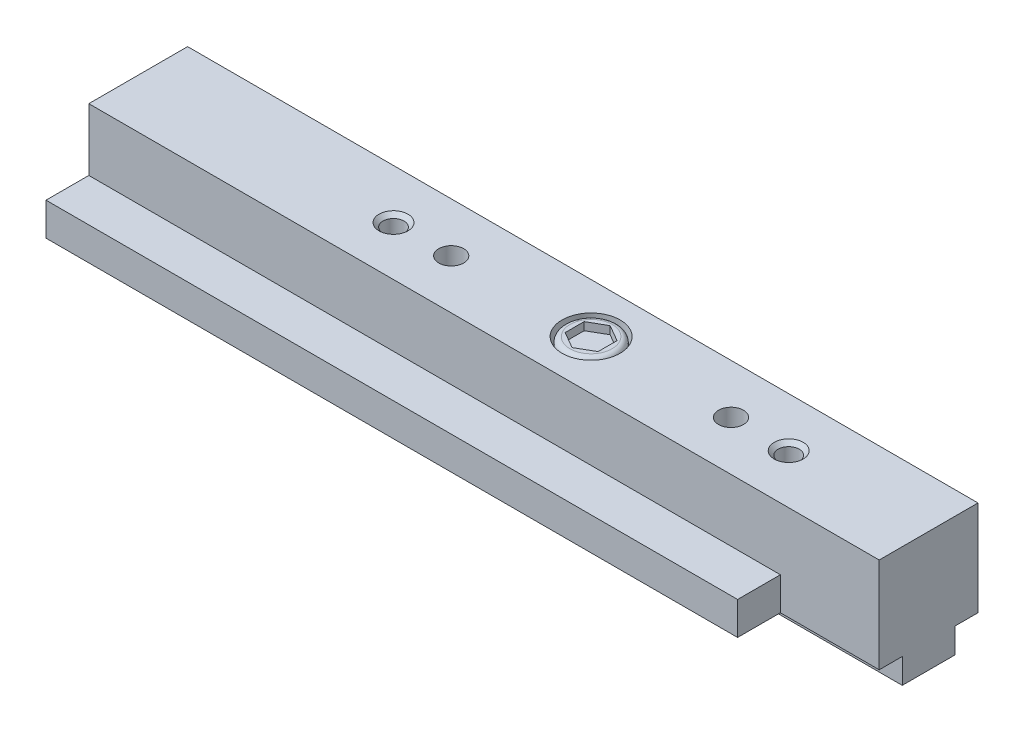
ISO-10303-21;
HEADER;
FILE_DESCRIPTION(('STEP AP214'),'2;1');
FILE_NAME('part.step','',(''),(''),'','','');
FILE_SCHEMA(('AUTOMOTIVE_DESIGN { 1 0 10303 214 1 1 1 1 }'));
ENDSEC;
DATA;
#1=APPLICATION_CONTEXT('core data for automotive mechanical design processes');
#2=APPLICATION_PROTOCOL_DEFINITION('international standard','automotive_design',2000,#1);
#3=PRODUCT_CONTEXT('',#1,'mechanical');
#4=PRODUCT('Part','Part','',(#3));
#5=PRODUCT_RELATED_PRODUCT_CATEGORY('part','',(#4));
#6=PRODUCT_DEFINITION_FORMATION('','',#4);
#7=PRODUCT_DEFINITION_CONTEXT('part definition',#1,'design');
#8=PRODUCT_DEFINITION('design','',#6,#7);
#9=PRODUCT_DEFINITION_SHAPE('','',#8);
#10=(LENGTH_UNIT() NAMED_UNIT(*) SI_UNIT(.MILLI.,.METRE.));
#11=(NAMED_UNIT(*) PLANE_ANGLE_UNIT() SI_UNIT($,.RADIAN.));
#12=(NAMED_UNIT(*) SI_UNIT($,.STERADIAN.) SOLID_ANGLE_UNIT());
#13=UNCERTAINTY_MEASURE_WITH_UNIT(LENGTH_MEASURE(1.E-05),#10,'distance_accuracy_value','');
#14=(GEOMETRIC_REPRESENTATION_CONTEXT(3) GLOBAL_UNCERTAINTY_ASSIGNED_CONTEXT((#13)) GLOBAL_UNIT_ASSIGNED_CONTEXT((#10,
#11,#12)) REPRESENTATION_CONTEXT('',''));
#15=CARTESIAN_POINT('',(0.,0.,0.));
#16=DIRECTION('',(0.,0.,1.));
#17=DIRECTION('',(1.,0.,0.));
#18=AXIS2_PLACEMENT_3D('',#15,#16,#17);
#19=CARTESIAN_POINT('',(43.6626,10.0584,0.));
#20=DIRECTION('',(0.,1.,0.));
#21=DIRECTION('',(0.,0.,1.));
#22=AXIS2_PLACEMENT_3D('',#19,#20,#21);
#23=PLANE('',#22);
#24=CARTESIAN_POINT('',(43.6626,10.0584,0.));
#25=DIRECTION('',(0.,1.,0.));
#26=DIRECTION('',(0.,0.,1.));
#27=AXIS2_PLACEMENT_3D('',#24,#25,#26);
#28=CIRCLE('',#27,2.794);
#29=CARTESIAN_POINT('',(43.6626,10.0584,2.794));
#30=VERTEX_POINT('',#29);
#31=EDGE_CURVE('E242',#30,#30,#28,.T.);
#32=ORIENTED_EDGE('',*,*,#31,.T.);
#33=EDGE_LOOP('',(#32));
#34=FACE_BOUND('',#33,.T.);
#35=CARTESIAN_POINT('',(43.6626,10.0584,0.));
#36=DIRECTION('',(0.,1.,0.));
#37=DIRECTION('',(0.,0.,1.));
#38=AXIS2_PLACEMENT_3D('',#35,#36,#37);
#39=CIRCLE('',#38,2.54);
#40=CARTESIAN_POINT('',(43.6626,10.0584,2.54));
#41=VERTEX_POINT('',#40);
#42=EDGE_CURVE('E225',#41,#41,#39,.T.);
#43=ORIENTED_EDGE('',*,*,#42,.F.);
#44=EDGE_LOOP('',(#43));
#45=FACE_BOUND('',#44,.T.);
#46=ADVANCED_FACE('F33',(#34,#45),#23,.T.);
#47=CARTESIAN_POINT('',(66.675,11.5824,-4.7625));
#48=DIRECTION('',(0.,-1.,0.));
#49=DIRECTION('',(0.,0.,-1.));
#50=AXIS2_PLACEMENT_3D('',#47,#48,#49);
#51=PLANE('',#50);
#52=CARTESIAN_POINT('',(43.6626,11.5824,0.));
#53=DIRECTION('',(0.,1.,0.));
#54=DIRECTION('',(0.,0.,1.));
#55=AXIS2_PLACEMENT_3D('',#52,#53,#54);
#56=CIRCLE('',#55,2.794);
#57=CARTESIAN_POINT('',(43.6626,11.5824,2.794));
#58=VERTEX_POINT('',#57);
#59=EDGE_CURVE('E241',#58,#58,#56,.T.);
#60=ORIENTED_EDGE('',*,*,#59,.F.);
#61=EDGE_LOOP('',(#60));
#62=FACE_BOUND('',#61,.T.);
#63=CARTESIAN_POINT('',(30.1752,11.5824,0.));
#64=DIRECTION('',(0.,1.,0.));
#65=DIRECTION('',(0.,0.,1.));
#66=AXIS2_PLACEMENT_3D('',#63,#64,#65);
#67=CIRCLE('',#66,1.20269);
#68=CARTESIAN_POINT('',(30.1752,11.5824,1.20269));
#69=VERTEX_POINT('',#68);
#70=EDGE_CURVE('E245',#69,#69,#67,.T.);
#71=ORIENTED_EDGE('',*,*,#70,.F.);
#72=EDGE_LOOP('',(#71));
#73=FACE_BOUND('',#72,.T.);
#74=CARTESIAN_POINT('',(57.15,11.5824,0.));
#75=DIRECTION('',(0.,1.,0.));
#76=DIRECTION('',(0.,0.,1.));
#77=AXIS2_PLACEMENT_3D('',#74,#75,#76);
#78=CIRCLE('',#77,1.20269);
#79=CARTESIAN_POINT('',(57.15,11.5824,1.20269));
#80=VERTEX_POINT('',#79);
#81=EDGE_CURVE('E251',#80,#80,#78,.T.);
#82=ORIENTED_EDGE('',*,*,#81,.F.);
#83=EDGE_LOOP('',(#82));
#84=FACE_BOUND('',#83,.T.);
#85=CARTESIAN_POINT('',(62.7126,11.5824,0.));
#86=DIRECTION('',(0.,1.,0.));
#87=DIRECTION('',(0.,0.,1.));
#88=AXIS2_PLACEMENT_3D('',#85,#86,#87);
#89=CIRCLE('',#88,1.397);
#90=CARTESIAN_POINT('',(62.7126,11.5824,1.397));
#91=VERTEX_POINT('',#90);
#92=EDGE_CURVE('E274',#91,#91,#89,.T.);
#93=ORIENTED_EDGE('',*,*,#92,.F.);
#94=EDGE_LOOP('',(#93));
#95=FACE_BOUND('',#94,.T.);
#96=DIRECTION('',(0.,0.,1.));
#97=VECTOR('',#96,1.);
#98=CARTESIAN_POINT('',(0.,11.5824,-4.7625));
#99=LINE('',#98,#97);
#100=CARTESIAN_POINT('',(0.,11.5824,-4.7625));
#101=VERTEX_POINT('',#100);
#102=CARTESIAN_POINT('',(0.,11.5824,4.7625));
#103=VERTEX_POINT('',#102);
#104=EDGE_CURVE('E400',#101,#103,#99,.T.);
#105=ORIENTED_EDGE('',*,*,#104,.T.);
#106=DIRECTION('',(-1.,0.,0.));
#107=VECTOR('',#106,1.);
#108=CARTESIAN_POINT('',(66.675,11.5824,4.7625));
#109=LINE('',#108,#107);
#110=CARTESIAN_POINT('',(76.2,11.5824,4.7625));
#111=VERTEX_POINT('',#110);
#112=EDGE_CURVE('E336',#111,#103,#109,.T.);
#113=ORIENTED_EDGE('',*,*,#112,.F.);
#114=DIRECTION('',(0.,0.,1.));
#115=VECTOR('',#114,1.);
#116=CARTESIAN_POINT('',(76.2,11.5824,-4.7625));
#117=LINE('',#116,#115);
#118=CARTESIAN_POINT('',(76.2,11.5824,-4.7625));
#119=VERTEX_POINT('',#118);
#120=EDGE_CURVE('E297',#119,#111,#117,.T.);
#121=ORIENTED_EDGE('',*,*,#120,.F.);
#122=DIRECTION('',(-1.,0.,0.));
#123=VECTOR('',#122,1.);
#124=CARTESIAN_POINT('',(66.675,11.5824,-4.7625));
#125=LINE('',#124,#123);
#126=EDGE_CURVE('E320',#119,#101,#125,.T.);
#127=ORIENTED_EDGE('',*,*,#126,.T.);
#128=EDGE_LOOP('',(#105,#113,#121,#127));
#129=FACE_BOUND('',#128,.T.);
#130=CARTESIAN_POINT('',(24.6126,11.5824,0.));
#131=DIRECTION('',(0.,1.,0.));
#132=DIRECTION('',(0.,0.,1.));
#133=AXIS2_PLACEMENT_3D('',#130,#131,#132);
#134=CIRCLE('',#133,1.397);
#135=CARTESIAN_POINT('',(24.6126,11.5824,1.397));
#136=VERTEX_POINT('',#135);
#137=EDGE_CURVE('E265',#136,#136,#134,.T.);
#138=ORIENTED_EDGE('',*,*,#137,.F.);
#139=EDGE_LOOP('',(#138));
#140=FACE_BOUND('',#139,.T.);
#141=ADVANCED_FACE('F428',(#62,#73,#84,#95,#129,#140),#51,.F.);
#142=CARTESIAN_POINT('',(66.675,2.413,8.89));
#143=DIRECTION('',(1.,0.,0.));
#144=DIRECTION('',(0.,0.,-1.));
#145=AXIS2_PLACEMENT_3D('',#142,#143,#144);
#146=PLANE('',#145);
#147=DIRECTION('',(0.,-1.,0.));
#148=VECTOR('',#147,1.);
#149=CARTESIAN_POINT('',(66.675,11.5824,4.7625));
#150=LINE('',#149,#148);
#151=CARTESIAN_POINT('',(66.675,5.588,4.7625));
#152=VERTEX_POINT('',#151);
#153=CARTESIAN_POINT('',(66.675,2.413,4.7625));
#154=VERTEX_POINT('',#153);
#155=EDGE_CURVE('E11',#152,#154,#150,.T.);
#156=ORIENTED_EDGE('',*,*,#155,.F.);
#157=DIRECTION('',(0.,0.,1.));
#158=VECTOR('',#157,1.);
#159=CARTESIAN_POINT('',(66.675,5.588,4.7625));
#160=LINE('',#159,#158);
#161=CARTESIAN_POINT('',(66.675,5.588,8.89));
#162=VERTEX_POINT('',#161);
#163=EDGE_CURVE('E312',#152,#162,#160,.T.);
#164=ORIENTED_EDGE('',*,*,#163,.T.);
#165=DIRECTION('',(0.,-1.,0.));
#166=VECTOR('',#165,1.);
#167=CARTESIAN_POINT('',(66.675,5.588,8.89));
#168=LINE('',#167,#166);
#169=CARTESIAN_POINT('',(66.675,2.413,8.89));
#170=VERTEX_POINT('',#169);
#171=EDGE_CURVE('E377',#162,#170,#168,.T.);
#172=ORIENTED_EDGE('',*,*,#171,.T.);
#173=DIRECTION('',(0.,0.,-1.));
#174=VECTOR('',#173,1.);
#175=CARTESIAN_POINT('',(66.675,2.413,8.89));
#176=LINE('',#175,#174);
#177=EDGE_CURVE('E375',#170,#154,#176,.T.);
#178=ORIENTED_EDGE('',*,*,#177,.T.);
#179=EDGE_LOOP('',(#156,#164,#172,#178));
#180=FACE_BOUND('',#179,.T.);
#181=ADVANCED_FACE('F408',(#180),#146,.T.);
#182=CARTESIAN_POINT('',(66.675,5.588,8.89));
#183=DIRECTION('',(0.,0.,-1.));
#184=DIRECTION('',(-1.,0.,0.));
#185=AXIS2_PLACEMENT_3D('',#182,#183,#184);
#186=PLANE('',#185);
#187=DIRECTION('',(0.,-1.,0.));
#188=VECTOR('',#187,1.);
#189=CARTESIAN_POINT('',(0.,5.588,8.89));
#190=LINE('',#189,#188);
#191=CARTESIAN_POINT('',(0.,5.588,8.89));
#192=VERTEX_POINT('',#191);
#193=CARTESIAN_POINT('',(0.,2.413,8.89));
#194=VERTEX_POINT('',#193);
#195=EDGE_CURVE('E330',#192,#194,#190,.T.);
#196=ORIENTED_EDGE('',*,*,#195,.T.);
#197=DIRECTION('',(-1.,0.,0.));
#198=VECTOR('',#197,1.);
#199=CARTESIAN_POINT('',(66.675,2.413,8.89));
#200=LINE('',#199,#198);
#201=EDGE_CURVE('E42',#170,#194,#200,.T.);
#202=ORIENTED_EDGE('',*,*,#201,.F.);
#203=ORIENTED_EDGE('',*,*,#171,.F.);
#204=DIRECTION('',(-1.,0.,0.));
#205=VECTOR('',#204,1.);
#206=CARTESIAN_POINT('',(66.675,5.588,8.89));
#207=LINE('',#206,#205);
#208=EDGE_CURVE('E337',#162,#192,#207,.T.);
#209=ORIENTED_EDGE('',*,*,#208,.T.);
#210=EDGE_LOOP('',(#196,#202,#203,#209));
#211=FACE_BOUND('',#210,.T.);
#212=ADVANCED_FACE('F35',(#211),#186,.F.);
#213=CARTESIAN_POINT('',(66.675,2.413,8.89));
#214=DIRECTION('',(0.,1.,0.));
#215=DIRECTION('',(0.,0.,1.));
#216=AXIS2_PLACEMENT_3D('',#213,#214,#215);
#217=PLANE('',#216);
#218=DIRECTION('',(0.,0.,-1.));
#219=VECTOR('',#218,1.);
#220=CARTESIAN_POINT('',(0.,2.413,8.89));
#221=LINE('',#220,#219);
#222=CARTESIAN_POINT('',(0.,2.413,2.54));
#223=VERTEX_POINT('',#222);
#224=EDGE_CURVE('E384',#194,#223,#221,.T.);
#225=ORIENTED_EDGE('',*,*,#224,.T.);
#226=DIRECTION('',(-1.,0.,0.));
#227=VECTOR('',#226,1.);
#228=CARTESIAN_POINT('',(66.675,2.413,2.54));
#229=LINE('',#228,#227);
#230=CARTESIAN_POINT('',(76.2,2.413,2.54));
#231=VERTEX_POINT('',#230);
#232=EDGE_CURVE('E371',#231,#223,#229,.T.);
#233=ORIENTED_EDGE('',*,*,#232,.F.);
#234=DIRECTION('',(0.,0.,-1.));
#235=VECTOR('',#234,1.);
#236=CARTESIAN_POINT('',(76.2,2.413,4.7625));
#237=LINE('',#236,#235);
#238=CARTESIAN_POINT('',(76.2,2.413,4.7625));
#239=VERTEX_POINT('',#238);
#240=EDGE_CURVE('E280',#239,#231,#237,.T.);
#241=ORIENTED_EDGE('',*,*,#240,.F.);
#242=DIRECTION('',(-1.,0.,0.));
#243=VECTOR('',#242,1.);
#244=CARTESIAN_POINT('',(76.2,2.413,4.7625));
#245=LINE('',#244,#243);
#246=EDGE_CURVE('E325',#239,#154,#245,.T.);
#247=ORIENTED_EDGE('',*,*,#246,.T.);
#248=ORIENTED_EDGE('',*,*,#177,.F.);
#249=ORIENTED_EDGE('',*,*,#201,.T.);
#250=EDGE_LOOP('',(#225,#233,#241,#247,#248,#249));
#251=FACE_BOUND('',#250,.T.);
#252=ADVANCED_FACE('F410',(#251),#217,.F.);
#253=CARTESIAN_POINT('',(66.675,2.413,2.54));
#254=DIRECTION('',(0.,0.,-1.));
#255=DIRECTION('',(-1.,0.,0.));
#256=AXIS2_PLACEMENT_3D('',#253,#254,#255);
#257=PLANE('',#256);
#258=DIRECTION('',(0.,-1.,0.));
#259=VECTOR('',#258,1.);
#260=CARTESIAN_POINT('',(0.,2.413,2.54));
#261=LINE('',#260,#259);
#262=CARTESIAN_POINT('',(0.,0.,2.54));
#263=VERTEX_POINT('',#262);
#264=EDGE_CURVE('E386',#223,#263,#261,.T.);
#265=ORIENTED_EDGE('',*,*,#264,.T.);
#266=DIRECTION('',(-1.,0.,0.));
#267=VECTOR('',#266,1.);
#268=CARTESIAN_POINT('',(66.675,0.,2.54));
#269=LINE('',#268,#267);
#270=CARTESIAN_POINT('',(76.2,0.,2.54));
#271=VERTEX_POINT('',#270);
#272=EDGE_CURVE('E368',#271,#263,#269,.T.);
#273=ORIENTED_EDGE('',*,*,#272,.F.);
#274=DIRECTION('',(0.,-1.,0.));
#275=VECTOR('',#274,1.);
#276=CARTESIAN_POINT('',(76.2,2.413,2.54));
#277=LINE('',#276,#275);
#278=EDGE_CURVE('E283',#231,#271,#277,.T.);
#279=ORIENTED_EDGE('',*,*,#278,.F.);
#280=ORIENTED_EDGE('',*,*,#232,.T.);
#281=EDGE_LOOP('',(#265,#273,#279,#280));
#282=FACE_BOUND('',#281,.T.);
#283=ADVANCED_FACE('F496',(#282),#257,.F.);
#284=CARTESIAN_POINT('',(66.675,0.,2.54));
#285=DIRECTION('',(0.,1.,0.));
#286=DIRECTION('',(0.,0.,1.));
#287=AXIS2_PLACEMENT_3D('',#284,#285,#286);
#288=PLANE('',#287);
#289=DIRECTION('',(0.,0.,-1.));
#290=VECTOR('',#289,1.);
#291=CARTESIAN_POINT('',(0.,0.,2.54));
#292=LINE('',#291,#290);
#293=CARTESIAN_POINT('',(0.,0.,-2.54));
#294=VERTEX_POINT('',#293);
#295=EDGE_CURVE('E388',#263,#294,#292,.T.);
#296=ORIENTED_EDGE('',*,*,#295,.T.);
#297=DIRECTION('',(-1.,0.,0.));
#298=VECTOR('',#297,1.);
#299=CARTESIAN_POINT('',(66.675,0.,-2.54));
#300=LINE('',#299,#298);
#301=CARTESIAN_POINT('',(76.2,0.,-2.54));
#302=VERTEX_POINT('',#301);
#303=EDGE_CURVE('E365',#302,#294,#300,.T.);
#304=ORIENTED_EDGE('',*,*,#303,.F.);
#305=DIRECTION('',(0.,0.,-1.));
#306=VECTOR('',#305,1.);
#307=CARTESIAN_POINT('',(76.2,0.,2.54));
#308=LINE('',#307,#306);
#309=EDGE_CURVE('E286',#271,#302,#308,.T.);
#310=ORIENTED_EDGE('',*,*,#309,.F.);
#311=ORIENTED_EDGE('',*,*,#272,.T.);
#312=EDGE_LOOP('',(#296,#304,#310,#311));
#313=FACE_BOUND('',#312,.T.);
#314=ADVANCED_FACE('F500',(#313),#288,.F.);
#315=CARTESIAN_POINT('',(66.675,0.,-2.54));
#316=DIRECTION('',(0.,0.,1.));
#317=DIRECTION('',(1.,0.,0.));
#318=AXIS2_PLACEMENT_3D('',#315,#316,#317);
#319=PLANE('',#318);
#320=DIRECTION('',(0.,1.,0.));
#321=VECTOR('',#320,1.);
#322=CARTESIAN_POINT('',(0.,0.,-2.54));
#323=LINE('',#322,#321);
#324=CARTESIAN_POINT('',(0.,2.413,-2.54));
#325=VERTEX_POINT('',#324);
#326=EDGE_CURVE('E390',#294,#325,#323,.T.);
#327=ORIENTED_EDGE('',*,*,#326,.T.);
#328=DIRECTION('',(-1.,0.,0.));
#329=VECTOR('',#328,1.);
#330=CARTESIAN_POINT('',(66.675,2.413,-2.54));
#331=LINE('',#330,#329);
#332=CARTESIAN_POINT('',(76.2,2.413,-2.54));
#333=VERTEX_POINT('',#332);
#334=EDGE_CURVE('E362',#333,#325,#331,.T.);
#335=ORIENTED_EDGE('',*,*,#334,.F.);
#336=DIRECTION('',(0.,1.,0.));
#337=VECTOR('',#336,1.);
#338=CARTESIAN_POINT('',(76.2,0.,-2.54));
#339=LINE('',#338,#337);
#340=EDGE_CURVE('E289',#302,#333,#339,.T.);
#341=ORIENTED_EDGE('',*,*,#340,.F.);
#342=ORIENTED_EDGE('',*,*,#303,.T.);
#343=EDGE_LOOP('',(#327,#335,#341,#342));
#344=FACE_BOUND('',#343,.T.);
#345=ADVANCED_FACE('F504',(#344),#319,.F.);
#346=CARTESIAN_POINT('',(66.675,2.413,-2.54));
#347=DIRECTION('',(0.,1.,0.));
#348=DIRECTION('',(0.,0.,1.));
#349=AXIS2_PLACEMENT_3D('',#346,#347,#348);
#350=PLANE('',#349);
#351=DIRECTION('',(0.,0.,-1.));
#352=VECTOR('',#351,1.);
#353=CARTESIAN_POINT('',(0.,2.413,-2.54));
#354=LINE('',#353,#352);
#355=CARTESIAN_POINT('',(0.,2.413,-8.89));
#356=VERTEX_POINT('',#355);
#357=EDGE_CURVE('E392',#325,#356,#354,.T.);
#358=ORIENTED_EDGE('',*,*,#357,.T.);
#359=DIRECTION('',(-1.,0.,0.));
#360=VECTOR('',#359,1.);
#361=CARTESIAN_POINT('',(66.675,2.413,-8.89));
#362=LINE('',#361,#360);
#363=CARTESIAN_POINT('',(66.675,2.413,-8.89));
#364=VERTEX_POINT('',#363);
#365=EDGE_CURVE('E359',#364,#356,#362,.T.);
#366=ORIENTED_EDGE('',*,*,#365,.F.);
#367=DIRECTION('',(0.,0.,-1.));
#368=VECTOR('',#367,1.);
#369=CARTESIAN_POINT('',(66.675,2.413,-2.54));
#370=LINE('',#369,#368);
#371=CARTESIAN_POINT('',(66.675,2.413,-4.7625));
#372=VERTEX_POINT('',#371);
#373=EDGE_CURVE('E307',#372,#364,#370,.T.);
#374=ORIENTED_EDGE('',*,*,#373,.F.);
#375=DIRECTION('',(-1.,0.,0.));
#376=VECTOR('',#375,1.);
#377=CARTESIAN_POINT('',(76.2,2.413,-4.7625));
#378=LINE('',#377,#376);
#379=CARTESIAN_POINT('',(76.2,2.413,-4.7625));
#380=VERTEX_POINT('',#379);
#381=EDGE_CURVE('E300',#380,#372,#378,.T.);
#382=ORIENTED_EDGE('',*,*,#381,.F.);
#383=DIRECTION('',(0.,0.,-1.));
#384=VECTOR('',#383,1.);
#385=CARTESIAN_POINT('',(76.2,2.413,-2.54));
#386=LINE('',#385,#384);
#387=EDGE_CURVE('E292',#333,#380,#386,.T.);
#388=ORIENTED_EDGE('',*,*,#387,.F.);
#389=ORIENTED_EDGE('',*,*,#334,.T.);
#390=EDGE_LOOP('',(#358,#366,#374,#382,#388,#389));
#391=FACE_BOUND('',#390,.T.);
#392=ADVANCED_FACE('F507',(#391),#350,.F.);
#393=CARTESIAN_POINT('',(66.675,2.413,-8.89));
#394=DIRECTION('',(0.,0.,1.));
#395=DIRECTION('',(1.,0.,0.));
#396=AXIS2_PLACEMENT_3D('',#393,#394,#395);
#397=PLANE('',#396);
#398=DIRECTION('',(0.,1.,0.));
#399=VECTOR('',#398,1.);
#400=CARTESIAN_POINT('',(0.,2.413,-8.89));
#401=LINE('',#400,#399);
#402=CARTESIAN_POINT('',(0.,5.588,-8.89));
#403=VERTEX_POINT('',#402);
#404=EDGE_CURVE('E394',#356,#403,#401,.T.);
#405=ORIENTED_EDGE('',*,*,#404,.T.);
#406=DIRECTION('',(-1.,0.,0.));
#407=VECTOR('',#406,1.);
#408=CARTESIAN_POINT('',(66.675,5.588,-8.89));
#409=LINE('',#408,#407);
#410=CARTESIAN_POINT('',(66.675,5.588,-8.89));
#411=VERTEX_POINT('',#410);
#412=EDGE_CURVE('E319',#411,#403,#409,.T.);
#413=ORIENTED_EDGE('',*,*,#412,.F.);
#414=DIRECTION('',(0.,1.,0.));
#415=VECTOR('',#414,1.);
#416=CARTESIAN_POINT('',(66.675,2.413,-8.89));
#417=LINE('',#416,#415);
#418=EDGE_CURVE('E313',#364,#411,#417,.T.);
#419=ORIENTED_EDGE('',*,*,#418,.F.);
#420=ORIENTED_EDGE('',*,*,#365,.T.);
#421=EDGE_LOOP('',(#405,#413,#419,#420));
#422=FACE_BOUND('',#421,.T.);
#423=ADVANCED_FACE('F515',(#422),#397,.F.);
#424=CARTESIAN_POINT('',(66.675,5.588,-8.89));
#425=DIRECTION('',(0.,-1.,0.));
#426=DIRECTION('',(0.,0.,-1.));
#427=AXIS2_PLACEMENT_3D('',#424,#425,#426);
#428=PLANE('',#427);
#429=DIRECTION('',(0.,0.,1.));
#430=VECTOR('',#429,1.);
#431=CARTESIAN_POINT('',(0.,5.588,-8.89));
#432=LINE('',#431,#430);
#433=CARTESIAN_POINT('',(0.,5.588,-4.7625));
#434=VERTEX_POINT('',#433);
#435=EDGE_CURVE('E396',#403,#434,#432,.T.);
#436=ORIENTED_EDGE('',*,*,#435,.T.);
#437=DIRECTION('',(-1.,0.,0.));
#438=VECTOR('',#437,1.);
#439=CARTESIAN_POINT('',(66.675,5.588,-4.7625));
#440=LINE('',#439,#438);
#441=CARTESIAN_POINT('',(66.675,5.588,-4.7625));
#442=VERTEX_POINT('',#441);
#443=EDGE_CURVE('E316',#442,#434,#440,.T.);
#444=ORIENTED_EDGE('',*,*,#443,.F.);
#445=DIRECTION('',(0.,0.,1.));
#446=VECTOR('',#445,1.);
#447=CARTESIAN_POINT('',(66.675,5.588,-8.89));
#448=LINE('',#447,#446);
#449=EDGE_CURVE('E310',#411,#442,#448,.T.);
#450=ORIENTED_EDGE('',*,*,#449,.F.);
#451=ORIENTED_EDGE('',*,*,#412,.T.);
#452=EDGE_LOOP('',(#436,#444,#450,#451));
#453=FACE_BOUND('',#452,.T.);
#454=ADVANCED_FACE('F519',(#453),#428,.F.);
#455=CARTESIAN_POINT('',(66.675,5.588,-4.7625));
#456=DIRECTION('',(0.,0.,1.));
#457=DIRECTION('',(1.,0.,0.));
#458=AXIS2_PLACEMENT_3D('',#455,#456,#457);
#459=PLANE('',#458);
#460=DIRECTION('',(0.,1.,0.));
#461=VECTOR('',#460,1.);
#462=CARTESIAN_POINT('',(0.,5.588,-4.7625));
#463=LINE('',#462,#461);
#464=EDGE_CURVE('E398',#434,#101,#463,.T.);
#465=ORIENTED_EDGE('',*,*,#464,.T.);
#466=ORIENTED_EDGE('',*,*,#126,.F.);
#467=DIRECTION('',(0.,1.,0.));
#468=VECTOR('',#467,1.);
#469=CARTESIAN_POINT('',(76.2,2.413,-4.7625));
#470=LINE('',#469,#468);
#471=EDGE_CURVE('E294',#380,#119,#470,.T.);
#472=ORIENTED_EDGE('',*,*,#471,.F.);
#473=ORIENTED_EDGE('',*,*,#381,.T.);
#474=DIRECTION('',(0.,1.,0.));
#475=VECTOR('',#474,1.);
#476=CARTESIAN_POINT('',(66.675,2.413,-4.7625));
#477=LINE('',#476,#475);
#478=EDGE_CURVE('E58',#372,#442,#477,.T.);
#479=ORIENTED_EDGE('',*,*,#478,.T.);
#480=ORIENTED_EDGE('',*,*,#443,.T.);
#481=EDGE_LOOP('',(#465,#466,#472,#473,#479,#480));
#482=FACE_BOUND('',#481,.T.);
#483=ADVANCED_FACE('F424',(#482),#459,.F.);
#484=CARTESIAN_POINT('',(66.675,11.5824,4.7625));
#485=DIRECTION('',(0.,0.,-1.));
#486=DIRECTION('',(-1.,0.,0.));
#487=AXIS2_PLACEMENT_3D('',#484,#485,#486);
#488=PLANE('',#487);
#489=DIRECTION('',(0.,-1.,0.));
#490=VECTOR('',#489,1.);
#491=CARTESIAN_POINT('',(0.,11.5824,4.7625));
#492=LINE('',#491,#490);
#493=CARTESIAN_POINT('',(0.,5.588,4.7625));
#494=VERTEX_POINT('',#493);
#495=EDGE_CURVE('E401',#103,#494,#492,.T.);
#496=ORIENTED_EDGE('',*,*,#495,.T.);
#497=DIRECTION('',(-1.,0.,0.));
#498=VECTOR('',#497,1.);
#499=CARTESIAN_POINT('',(66.675,5.588,4.7625));
#500=LINE('',#499,#498);
#501=EDGE_CURVE('E333',#152,#494,#500,.T.);
#502=ORIENTED_EDGE('',*,*,#501,.F.);
#503=ORIENTED_EDGE('',*,*,#155,.T.);
#504=ORIENTED_EDGE('',*,*,#246,.F.);
#505=DIRECTION('',(0.,-1.,0.));
#506=VECTOR('',#505,1.);
#507=CARTESIAN_POINT('',(76.2,11.5824,4.7625));
#508=LINE('',#507,#506);
#509=EDGE_CURVE('E277',#111,#239,#508,.T.);
#510=ORIENTED_EDGE('',*,*,#509,.F.);
#511=ORIENTED_EDGE('',*,*,#112,.T.);
#512=EDGE_LOOP('',(#496,#502,#503,#504,#510,#511));
#513=FACE_BOUND('',#512,.T.);
#514=ADVANCED_FACE('F413',(#513),#488,.F.);
#515=CARTESIAN_POINT('',(66.675,5.588,4.7625));
#516=DIRECTION('',(0.,-1.,0.));
#517=DIRECTION('',(0.,0.,-1.));
#518=AXIS2_PLACEMENT_3D('',#515,#516,#517);
#519=PLANE('',#518);
#520=DIRECTION('',(0.,0.,1.));
#521=VECTOR('',#520,1.);
#522=CARTESIAN_POINT('',(0.,5.588,4.7625));
#523=LINE('',#522,#521);
#524=EDGE_CURVE('E351',#494,#192,#523,.T.);
#525=ORIENTED_EDGE('',*,*,#524,.T.);
#526=ORIENTED_EDGE('',*,*,#208,.F.);
#527=ORIENTED_EDGE('',*,*,#163,.F.);
#528=ORIENTED_EDGE('',*,*,#501,.T.);
#529=EDGE_LOOP('',(#525,#526,#527,#528));
#530=FACE_BOUND('',#529,.T.);
#531=ADVANCED_FACE('F414',(#530),#519,.F.);
#532=ORIENTED_EDGE('',*,*,#478,.F.);
#533=ORIENTED_EDGE('',*,*,#373,.T.);
#534=ORIENTED_EDGE('',*,*,#418,.T.);
#535=ORIENTED_EDGE('',*,*,#449,.T.);
#536=EDGE_LOOP('',(#532,#533,#534,#535));
#537=FACE_BOUND('',#536,.T.);
#538=ADVANCED_FACE('F416',(#537),#146,.T.);
#539=CARTESIAN_POINT('',(0.,2.413,8.89));
#540=DIRECTION('',(1.,0.,0.));
#541=DIRECTION('',(0.,0.,-1.));
#542=AXIS2_PLACEMENT_3D('',#539,#540,#541);
#543=PLANE('',#542);
#544=ORIENTED_EDGE('',*,*,#195,.F.);
#545=ORIENTED_EDGE('',*,*,#524,.F.);
#546=ORIENTED_EDGE('',*,*,#495,.F.);
#547=ORIENTED_EDGE('',*,*,#104,.F.);
#548=ORIENTED_EDGE('',*,*,#464,.F.);
#549=ORIENTED_EDGE('',*,*,#435,.F.);
#550=ORIENTED_EDGE('',*,*,#404,.F.);
#551=ORIENTED_EDGE('',*,*,#357,.F.);
#552=ORIENTED_EDGE('',*,*,#326,.F.);
#553=ORIENTED_EDGE('',*,*,#295,.F.);
#554=ORIENTED_EDGE('',*,*,#264,.F.);
#555=ORIENTED_EDGE('',*,*,#224,.F.);
#556=EDGE_LOOP('',(#544,#545,#546,#547,#548,#549,#550,#551,#552,#553,#554,#555));
#557=FACE_BOUND('',#556,.T.);
#558=ADVANCED_FACE('F422',(#557),#543,.F.);
#559=CARTESIAN_POINT('',(76.2,2.413,4.7625));
#560=DIRECTION('',(1.,0.,0.));
#561=DIRECTION('',(0.,0.,-1.));
#562=AXIS2_PLACEMENT_3D('',#559,#560,#561);
#563=PLANE('',#562);
#564=ORIENTED_EDGE('',*,*,#509,.T.);
#565=ORIENTED_EDGE('',*,*,#240,.T.);
#566=ORIENTED_EDGE('',*,*,#278,.T.);
#567=ORIENTED_EDGE('',*,*,#309,.T.);
#568=ORIENTED_EDGE('',*,*,#340,.T.);
#569=ORIENTED_EDGE('',*,*,#387,.T.);
#570=ORIENTED_EDGE('',*,*,#471,.T.);
#571=ORIENTED_EDGE('',*,*,#120,.T.);
#572=EDGE_LOOP('',(#564,#565,#566,#567,#568,#569,#570,#571));
#573=FACE_BOUND('',#572,.T.);
#574=ADVANCED_FACE('F484',(#573),#563,.T.);
#575=CARTESIAN_POINT('',(62.7126,11.2014,0.));
#576=DIRECTION('',(0.,1.,0.));
#577=DIRECTION('',(0.,0.,1.));
#578=AXIS2_PLACEMENT_3D('',#575,#576,#577);
#579=CONICAL_SURFACE('',#578,1.016,0.785398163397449);
#580=ORIENTED_EDGE('',*,*,#92,.T.);
#581=EDGE_LOOP('',(#580));
#582=FACE_BOUND('',#581,.T.);
#583=CARTESIAN_POINT('',(62.7126,11.2014,0.));
#584=DIRECTION('',(0.,1.,0.));
#585=DIRECTION('',(0.,0.,1.));
#586=AXIS2_PLACEMENT_3D('',#583,#584,#585);
#587=CIRCLE('',#586,1.016);
#588=CARTESIAN_POINT('',(62.7126,11.2014,1.016));
#589=VERTEX_POINT('',#588);
#590=EDGE_CURVE('E271',#589,#589,#587,.T.);
#591=ORIENTED_EDGE('',*,*,#590,.F.);
#592=EDGE_LOOP('',(#591));
#593=FACE_BOUND('',#592,.T.);
#594=ADVANCED_FACE('F480',(#582,#593),#579,.F.);
#595=CARTESIAN_POINT('',(62.7126,3.3274,0.));
#596=DIRECTION('',(0.,1.,0.));
#597=DIRECTION('',(0.,0.,1.));
#598=AXIS2_PLACEMENT_3D('',#595,#596,#597);
#599=CYLINDRICAL_SURFACE('',#598,1.016);
#600=ORIENTED_EDGE('',*,*,#590,.T.);
#601=EDGE_LOOP('',(#600));
#602=FACE_BOUND('',#601,.T.);
#603=CARTESIAN_POINT('',(62.7126,3.9139878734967,0.));
#604=DIRECTION('',(0.,1.,0.));
#605=DIRECTION('',(0.,0.,1.));
#606=AXIS2_PLACEMENT_3D('',#603,#604,#605);
#607=CIRCLE('',#606,1.016);
#608=CARTESIAN_POINT('',(62.7126,3.9139878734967,1.016));
#609=VERTEX_POINT('',#608);
#610=EDGE_CURVE('E268',#609,#609,#607,.T.);
#611=ORIENTED_EDGE('',*,*,#610,.F.);
#612=EDGE_LOOP('',(#611));
#613=FACE_BOUND('',#612,.T.);
#614=ADVANCED_FACE('F476',(#602,#613),#599,.F.);
#615=CARTESIAN_POINT('',(62.7126,3.3274,0.));
#616=DIRECTION('',(0.,1.,0.));
#617=DIRECTION('',(0.,0.,1.));
#618=AXIS2_PLACEMENT_3D('',#615,#616,#617);
#619=CONICAL_SURFACE('',#618,0.,1.04719755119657);
#620=ORIENTED_EDGE('',*,*,#610,.T.);
#621=EDGE_LOOP('',(#620));
#622=FACE_BOUND('',#621,.T.);
#623=CARTESIAN_POINT('',(62.7126,3.3274,0.));
#624=VERTEX_POINT('',#623);
#625=VERTEX_LOOP('',#624);
#626=FACE_BOUND('',#625,.T.);
#627=ADVANCED_FACE('F472',(#622,#626),#619,.F.);
#628=CARTESIAN_POINT('',(24.6126,11.2014,0.));
#629=DIRECTION('',(0.,1.,0.));
#630=DIRECTION('',(0.,0.,1.));
#631=AXIS2_PLACEMENT_3D('',#628,#629,#630);
#632=CONICAL_SURFACE('',#631,1.016,0.785398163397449);
#633=ORIENTED_EDGE('',*,*,#137,.T.);
#634=EDGE_LOOP('',(#633));
#635=FACE_BOUND('',#634,.T.);
#636=CARTESIAN_POINT('',(24.6126,11.2014,0.));
#637=DIRECTION('',(0.,1.,0.));
#638=DIRECTION('',(0.,0.,1.));
#639=AXIS2_PLACEMENT_3D('',#636,#637,#638);
#640=CIRCLE('',#639,1.016);
#641=CARTESIAN_POINT('',(24.6126,11.2014,1.016));
#642=VERTEX_POINT('',#641);
#643=EDGE_CURVE('E262',#642,#642,#640,.T.);
#644=ORIENTED_EDGE('',*,*,#643,.F.);
#645=EDGE_LOOP('',(#644));
#646=FACE_BOUND('',#645,.T.);
#647=ADVANCED_FACE('F468',(#635,#646),#632,.F.);
#648=CARTESIAN_POINT('',(24.6126,3.3274,0.));
#649=DIRECTION('',(0.,1.,0.));
#650=DIRECTION('',(0.,0.,1.));
#651=AXIS2_PLACEMENT_3D('',#648,#649,#650);
#652=CYLINDRICAL_SURFACE('',#651,1.016);
#653=ORIENTED_EDGE('',*,*,#643,.T.);
#654=EDGE_LOOP('',(#653));
#655=FACE_BOUND('',#654,.T.);
#656=CARTESIAN_POINT('',(24.6126,3.9139878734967,0.));
#657=DIRECTION('',(0.,1.,0.));
#658=DIRECTION('',(0.,0.,1.));
#659=AXIS2_PLACEMENT_3D('',#656,#657,#658);
#660=CIRCLE('',#659,1.016);
#661=CARTESIAN_POINT('',(24.6126,3.9139878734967,1.016));
#662=VERTEX_POINT('',#661);
#663=EDGE_CURVE('E257',#662,#662,#660,.T.);
#664=ORIENTED_EDGE('',*,*,#663,.F.);
#665=EDGE_LOOP('',(#664));
#666=FACE_BOUND('',#665,.T.);
#667=ADVANCED_FACE('F464',(#655,#666),#652,.F.);
#668=CARTESIAN_POINT('',(24.6126,3.3274,0.));
#669=DIRECTION('',(0.,1.,0.));
#670=DIRECTION('',(0.,0.,1.));
#671=AXIS2_PLACEMENT_3D('',#668,#669,#670);
#672=CONICAL_SURFACE('',#671,0.,1.04719755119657);
#673=ORIENTED_EDGE('',*,*,#663,.T.);
#674=EDGE_LOOP('',(#673));
#675=FACE_BOUND('',#674,.T.);
#676=CARTESIAN_POINT('',(24.6126,3.3274,0.));
#677=VERTEX_POINT('',#676);
#678=VERTEX_LOOP('',#677);
#679=FACE_BOUND('',#678,.T.);
#680=ADVANCED_FACE('F460',(#675,#679),#672,.F.);
#681=CARTESIAN_POINT('',(57.15,8.5344,0.));
#682=DIRECTION('',(0.,1.,0.));
#683=DIRECTION('',(0.,0.,1.));
#684=AXIS2_PLACEMENT_3D('',#681,#682,#683);
#685=CYLINDRICAL_SURFACE('',#684,1.20269);
#686=CARTESIAN_POINT('',(57.15,8.5344,0.));
#687=DIRECTION('',(0.,1.,0.));
#688=DIRECTION('',(0.,0.,1.));
#689=AXIS2_PLACEMENT_3D('',#686,#687,#688);
#690=CIRCLE('',#689,1.20269);
#691=CARTESIAN_POINT('',(57.15,8.5344,1.20269));
#692=VERTEX_POINT('',#691);
#693=EDGE_CURVE('E254',#692,#692,#690,.T.);
#694=CARTESIAN_POINT('',(57.15,8.5344,1.20269));
#695=CARTESIAN_POINT('',(57.15,8.56615,1.20269));
#696=CARTESIAN_POINT('',(57.15,8.5979,1.20269));
#697=CARTESIAN_POINT('',(57.15,8.6614,1.20269));
#698=CARTESIAN_POINT('',(57.15,8.69315,1.20269));
#699=CARTESIAN_POINT('',(57.15,8.75665,1.20269));
#700=CARTESIAN_POINT('',(57.15,8.7884,1.20269));
#701=CARTESIAN_POINT('',(57.15,8.8519,1.20269));
#702=CARTESIAN_POINT('',(57.15,8.88365,1.20269));
#703=CARTESIAN_POINT('',(57.15,8.94715,1.20269));
#704=CARTESIAN_POINT('',(57.15,8.9789,1.20269));
#705=CARTESIAN_POINT('',(57.15,9.0424,1.20269));
#706=CARTESIAN_POINT('',(57.15,9.07415,1.20269));
#707=CARTESIAN_POINT('',(57.15,9.13765,1.20269));
#708=CARTESIAN_POINT('',(57.15,9.1694,1.20269));
#709=CARTESIAN_POINT('',(57.15,9.2329,1.20269));
#710=CARTESIAN_POINT('',(57.15,9.26465,1.20269));
#711=CARTESIAN_POINT('',(57.15,9.32815,1.20269));
#712=CARTESIAN_POINT('',(57.15,9.3599,1.20269));
#713=CARTESIAN_POINT('',(57.15,9.4234,1.20269));
#714=CARTESIAN_POINT('',(57.15,9.45515,1.20269));
#715=CARTESIAN_POINT('',(57.15,9.51865,1.20269));
#716=CARTESIAN_POINT('',(57.15,9.5504,1.20269));
#717=CARTESIAN_POINT('',(57.15,9.6139,1.20269));
#718=CARTESIAN_POINT('',(57.15,9.64565,1.20269));
#719=CARTESIAN_POINT('',(57.15,9.70915,1.20269));
#720=CARTESIAN_POINT('',(57.15,9.7409,1.20269));
#721=CARTESIAN_POINT('',(57.15,9.8044,1.20269));
#722=CARTESIAN_POINT('',(57.15,9.83615,1.20269));
#723=CARTESIAN_POINT('',(57.15,9.89965,1.20269));
#724=CARTESIAN_POINT('',(57.15,9.9314,1.20269));
#725=CARTESIAN_POINT('',(57.15,9.9949,1.20269));
#726=CARTESIAN_POINT('',(57.15,10.02665,1.20269));
#727=CARTESIAN_POINT('',(57.15,10.09015,1.20269));
#728=CARTESIAN_POINT('',(57.15,10.1219,1.20269));
#729=CARTESIAN_POINT('',(57.15,10.1854,1.20269));
#730=CARTESIAN_POINT('',(57.15,10.21715,1.20269));
#731=CARTESIAN_POINT('',(57.15,10.28065,1.20269));
#732=CARTESIAN_POINT('',(57.15,10.3124,1.20269));
#733=CARTESIAN_POINT('',(57.15,10.3759,1.20269));
#734=CARTESIAN_POINT('',(57.15,10.40765,1.20269));
#735=CARTESIAN_POINT('',(57.15,10.47115,1.20269));
#736=CARTESIAN_POINT('',(57.15,10.5029,1.20269));
#737=CARTESIAN_POINT('',(57.15,10.5664,1.20269));
#738=CARTESIAN_POINT('',(57.15,10.59815,1.20269));
#739=CARTESIAN_POINT('',(57.15,10.66165,1.20269));
#740=CARTESIAN_POINT('',(57.15,10.6934,1.20269));
#741=CARTESIAN_POINT('',(57.15,10.7569,1.20269));
#742=CARTESIAN_POINT('',(57.15,10.78865,1.20269));
#743=CARTESIAN_POINT('',(57.15,10.85215,1.20269));
#744=CARTESIAN_POINT('',(57.15,10.8839,1.20269));
#745=CARTESIAN_POINT('',(57.15,10.9474,1.20269));
#746=CARTESIAN_POINT('',(57.15,10.97915,1.20269));
#747=CARTESIAN_POINT('',(57.15,11.04265,1.20269));
#748=CARTESIAN_POINT('',(57.15,11.0744,1.20269));
#749=CARTESIAN_POINT('',(57.15,11.1379,1.20269));
#750=CARTESIAN_POINT('',(57.15,11.16965,1.20269));
#751=CARTESIAN_POINT('',(57.15,11.23315,1.20269));
#752=CARTESIAN_POINT('',(57.15,11.2649,1.20269));
#753=CARTESIAN_POINT('',(57.15,11.3284,1.20269));
#754=CARTESIAN_POINT('',(57.15,11.36015,1.20269));
#755=CARTESIAN_POINT('',(57.15,11.42365,1.20269));
#756=CARTESIAN_POINT('',(57.15,11.4554,1.20269));
#757=CARTESIAN_POINT('',(57.15,11.5189,1.20269));
#758=CARTESIAN_POINT('',(57.15,11.55065,1.20269));
#759=CARTESIAN_POINT('',(57.15,11.5824,1.20269));
#760=B_SPLINE_CURVE_WITH_KNOTS('',3,(#694,#695,#696,#697,#698,#699,#700,#701,#702,#703,#704,
#705,#706,#707,#708,#709,#710,#711,#712,#713,#714,#715,#716,#717,#718,#719,#720,#721,#722,#723,
#724,#725,#726,#727,#728,#729,#730,#731,#732,#733,#734,#735,#736,#737,#738,#739,#740,#741,#742,
#743,#744,#745,#746,#747,#748,#749,#750,#751,#752,#753,#754,#755,#756,#757,#758,#759),
.UNSPECIFIED.,.F.,.F.,(4,2,2,2,2,2,2,2,2,2,2,2,2,2,2,2,2,2,2,2,2,2,2,2,2,2,2,2,2,2,2,2,4),(0.,
0.0952499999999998,0.1905,0.28575,0.380999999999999,0.476249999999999,0.571499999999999,
0.666749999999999,0.761999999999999,0.857249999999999,0.952499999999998,1.04775,1.143,1.23825,
1.3335,1.42875,1.524,1.61925,1.7145,1.80975,1.905,2.00025,2.0955,2.19075,2.286,2.38125,2.4765,
2.57175,2.667,2.76225,2.8575,2.95275,3.048),.UNSPECIFIED.);
#761=EDGE_CURVE('BSEAM456',#692,#80,#760,.T.);
#762=ORIENTED_EDGE('',*,*,#693,.F.);
#763=ORIENTED_EDGE('',*,*,#81,.T.);
#764=ORIENTED_EDGE('',*,*,#761,.T.);
#765=ORIENTED_EDGE('',*,*,#761,.F.);
#766=EDGE_LOOP('',(#762,#764,#763,#765));
#767=FACE_BOUND('',#766,.T.);
#768=ADVANCED_FACE('F456',(#767),#685,.F.);
#769=CARTESIAN_POINT('',(57.15,8.5344,0.));
#770=DIRECTION('',(0.,1.,0.));
#771=DIRECTION('',(0.,0.,1.));
#772=AXIS2_PLACEMENT_3D('',#769,#770,#771);
#773=PLANE('',#772);
#774=ORIENTED_EDGE('',*,*,#693,.T.);
#775=EDGE_LOOP('',(#774));
#776=FACE_BOUND('',#775,.T.);
#777=ADVANCED_FACE('F452',(#776),#773,.T.);
#778=CARTESIAN_POINT('',(30.1752,8.5344,0.));
#779=DIRECTION('',(0.,1.,0.));
#780=DIRECTION('',(0.,0.,1.));
#781=AXIS2_PLACEMENT_3D('',#778,#779,#780);
#782=CYLINDRICAL_SURFACE('',#781,1.20269);
#783=CARTESIAN_POINT('',(30.1752,8.5344,0.));
#784=DIRECTION('',(0.,1.,0.));
#785=DIRECTION('',(0.,0.,1.));
#786=AXIS2_PLACEMENT_3D('',#783,#784,#785);
#787=CIRCLE('',#786,1.20269);
#788=CARTESIAN_POINT('',(30.1752,8.5344,1.20269));
#789=VERTEX_POINT('',#788);
#790=EDGE_CURVE('E248',#789,#789,#787,.T.);
#791=CARTESIAN_POINT('',(30.1752,8.5344,1.20269));
#792=CARTESIAN_POINT('',(30.1752,8.56615,1.20269));
#793=CARTESIAN_POINT('',(30.1752,8.5979,1.20269));
#794=CARTESIAN_POINT('',(30.1752,8.6614,1.20269));
#795=CARTESIAN_POINT('',(30.1752,8.69315,1.20269));
#796=CARTESIAN_POINT('',(30.1752,8.75665,1.20269));
#797=CARTESIAN_POINT('',(30.1752,8.7884,1.20269));
#798=CARTESIAN_POINT('',(30.1752,8.8519,1.20269));
#799=CARTESIAN_POINT('',(30.1752,8.88365,1.20269));
#800=CARTESIAN_POINT('',(30.1752,8.94715,1.20269));
#801=CARTESIAN_POINT('',(30.1752,8.9789,1.20269));
#802=CARTESIAN_POINT('',(30.1752,9.0424,1.20269));
#803=CARTESIAN_POINT('',(30.1752,9.07415,1.20269));
#804=CARTESIAN_POINT('',(30.1752,9.13765,1.20269));
#805=CARTESIAN_POINT('',(30.1752,9.1694,1.20269));
#806=CARTESIAN_POINT('',(30.1752,9.2329,1.20269));
#807=CARTESIAN_POINT('',(30.1752,9.26465,1.20269));
#808=CARTESIAN_POINT('',(30.1752,9.32815,1.20269));
#809=CARTESIAN_POINT('',(30.1752,9.3599,1.20269));
#810=CARTESIAN_POINT('',(30.1752,9.4234,1.20269));
#811=CARTESIAN_POINT('',(30.1752,9.45515,1.20269));
#812=CARTESIAN_POINT('',(30.1752,9.51865,1.20269));
#813=CARTESIAN_POINT('',(30.1752,9.5504,1.20269));
#814=CARTESIAN_POINT('',(30.1752,9.6139,1.20269));
#815=CARTESIAN_POINT('',(30.1752,9.64565,1.20269));
#816=CARTESIAN_POINT('',(30.1752,9.70915,1.20269));
#817=CARTESIAN_POINT('',(30.1752,9.7409,1.20269));
#818=CARTESIAN_POINT('',(30.1752,9.8044,1.20269));
#819=CARTESIAN_POINT('',(30.1752,9.83615,1.20269));
#820=CARTESIAN_POINT('',(30.1752,9.89965,1.20269));
#821=CARTESIAN_POINT('',(30.1752,9.9314,1.20269));
#822=CARTESIAN_POINT('',(30.1752,9.9949,1.20269));
#823=CARTESIAN_POINT('',(30.1752,10.02665,1.20269));
#824=CARTESIAN_POINT('',(30.1752,10.09015,1.20269));
#825=CARTESIAN_POINT('',(30.1752,10.1219,1.20269));
#826=CARTESIAN_POINT('',(30.1752,10.1854,1.20269));
#827=CARTESIAN_POINT('',(30.1752,10.21715,1.20269));
#828=CARTESIAN_POINT('',(30.1752,10.28065,1.20269));
#829=CARTESIAN_POINT('',(30.1752,10.3124,1.20269));
#830=CARTESIAN_POINT('',(30.1752,10.3759,1.20269));
#831=CARTESIAN_POINT('',(30.1752,10.40765,1.20269));
#832=CARTESIAN_POINT('',(30.1752,10.47115,1.20269));
#833=CARTESIAN_POINT('',(30.1752,10.5029,1.20269));
#834=CARTESIAN_POINT('',(30.1752,10.5664,1.20269));
#835=CARTESIAN_POINT('',(30.1752,10.59815,1.20269));
#836=CARTESIAN_POINT('',(30.1752,10.66165,1.20269));
#837=CARTESIAN_POINT('',(30.1752,10.6934,1.20269));
#838=CARTESIAN_POINT('',(30.1752,10.7569,1.20269));
#839=CARTESIAN_POINT('',(30.1752,10.78865,1.20269));
#840=CARTESIAN_POINT('',(30.1752,10.85215,1.20269));
#841=CARTESIAN_POINT('',(30.1752,10.8839,1.20269));
#842=CARTESIAN_POINT('',(30.1752,10.9474,1.20269));
#843=CARTESIAN_POINT('',(30.1752,10.97915,1.20269));
#844=CARTESIAN_POINT('',(30.1752,11.04265,1.20269));
#845=CARTESIAN_POINT('',(30.1752,11.0744,1.20269));
#846=CARTESIAN_POINT('',(30.1752,11.1379,1.20269));
#847=CARTESIAN_POINT('',(30.1752,11.16965,1.20269));
#848=CARTESIAN_POINT('',(30.1752,11.23315,1.20269));
#849=CARTESIAN_POINT('',(30.1752,11.2649,1.20269));
#850=CARTESIAN_POINT('',(30.1752,11.3284,1.20269));
#851=CARTESIAN_POINT('',(30.1752,11.36015,1.20269));
#852=CARTESIAN_POINT('',(30.1752,11.42365,1.20269));
#853=CARTESIAN_POINT('',(30.1752,11.4554,1.20269));
#854=CARTESIAN_POINT('',(30.1752,11.5189,1.20269));
#855=CARTESIAN_POINT('',(30.1752,11.55065,1.20269));
#856=CARTESIAN_POINT('',(30.1752,11.5824,1.20269));
#857=B_SPLINE_CURVE_WITH_KNOTS('',3,(#791,#792,#793,#794,#795,#796,#797,#798,#799,#800,#801,
#802,#803,#804,#805,#806,#807,#808,#809,#810,#811,#812,#813,#814,#815,#816,#817,#818,#819,#820,
#821,#822,#823,#824,#825,#826,#827,#828,#829,#830,#831,#832,#833,#834,#835,#836,#837,#838,#839,
#840,#841,#842,#843,#844,#845,#846,#847,#848,#849,#850,#851,#852,#853,#854,#855,#856),
.UNSPECIFIED.,.F.,.F.,(4,2,2,2,2,2,2,2,2,2,2,2,2,2,2,2,2,2,2,2,2,2,2,2,2,2,2,2,2,2,2,2,4),(0.,
0.0952499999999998,0.1905,0.28575,0.380999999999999,0.476249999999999,0.571499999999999,
0.666749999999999,0.761999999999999,0.857249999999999,0.952499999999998,1.04775,1.143,1.23825,
1.3335,1.42875,1.524,1.61925,1.7145,1.80975,1.905,2.00025,2.0955,2.19075,2.286,2.38125,2.4765,
2.57175,2.667,2.76225,2.8575,2.95275,3.048),.UNSPECIFIED.);
#858=EDGE_CURVE('BSEAM448',#789,#69,#857,.T.);
#859=ORIENTED_EDGE('',*,*,#790,.F.);
#860=ORIENTED_EDGE('',*,*,#70,.T.);
#861=ORIENTED_EDGE('',*,*,#858,.T.);
#862=ORIENTED_EDGE('',*,*,#858,.F.);
#863=EDGE_LOOP('',(#859,#861,#860,#862));
#864=FACE_BOUND('',#863,.T.);
#865=ADVANCED_FACE('F448',(#864),#782,.F.);
#866=CARTESIAN_POINT('',(30.1752,8.5344,0.));
#867=DIRECTION('',(0.,1.,0.));
#868=DIRECTION('',(0.,0.,1.));
#869=AXIS2_PLACEMENT_3D('',#866,#867,#868);
#870=PLANE('',#869);
#871=ORIENTED_EDGE('',*,*,#790,.T.);
#872=EDGE_LOOP('',(#871));
#873=FACE_BOUND('',#872,.T.);
#874=ADVANCED_FACE('F444',(#873),#870,.T.);
#875=CARTESIAN_POINT('',(43.6626,10.0584,0.));
#876=DIRECTION('',(0.,1.,0.));
#877=DIRECTION('',(0.,0.,1.));
#878=AXIS2_PLACEMENT_3D('',#875,#876,#877);
#879=CYLINDRICAL_SURFACE('',#878,2.794);
#880=CARTESIAN_POINT('',(43.6626,10.0584,2.794));
#881=CARTESIAN_POINT('',(43.6626,10.074275,2.794));
#882=CARTESIAN_POINT('',(43.6626,10.09015,2.794));
#883=CARTESIAN_POINT('',(43.6626,10.1219,2.794));
#884=CARTESIAN_POINT('',(43.6626,10.137775,2.794));
#885=CARTESIAN_POINT('',(43.6626,10.169525,2.794));
#886=CARTESIAN_POINT('',(43.6626,10.1854,2.794));
#887=CARTESIAN_POINT('',(43.6626,10.21715,2.794));
#888=CARTESIAN_POINT('',(43.6626,10.233025,2.794));
#889=CARTESIAN_POINT('',(43.6626,10.264775,2.794));
#890=CARTESIAN_POINT('',(43.6626,10.28065,2.794));
#891=CARTESIAN_POINT('',(43.6626,10.3124,2.794));
#892=CARTESIAN_POINT('',(43.6626,10.328275,2.794));
#893=CARTESIAN_POINT('',(43.6626,10.360025,2.794));
#894=CARTESIAN_POINT('',(43.6626,10.3759,2.794));
#895=CARTESIAN_POINT('',(43.6626,10.40765,2.794));
#896=CARTESIAN_POINT('',(43.6626,10.423525,2.794));
#897=CARTESIAN_POINT('',(43.6626,10.455275,2.794));
#898=CARTESIAN_POINT('',(43.6626,10.47115,2.794));
#899=CARTESIAN_POINT('',(43.6626,10.5029,2.794));
#900=CARTESIAN_POINT('',(43.6626,10.518775,2.794));
#901=CARTESIAN_POINT('',(43.6626,10.550525,2.794));
#902=CARTESIAN_POINT('',(43.6626,10.5664,2.794));
#903=CARTESIAN_POINT('',(43.6626,10.59815,2.794));
#904=CARTESIAN_POINT('',(43.6626,10.614025,2.794));
#905=CARTESIAN_POINT('',(43.6626,10.645775,2.794));
#906=CARTESIAN_POINT('',(43.6626,10.66165,2.794));
#907=CARTESIAN_POINT('',(43.6626,10.6934,2.794));
#908=CARTESIAN_POINT('',(43.6626,10.709275,2.794));
#909=CARTESIAN_POINT('',(43.6626,10.741025,2.794));
#910=CARTESIAN_POINT('',(43.6626,10.7569,2.794));
#911=CARTESIAN_POINT('',(43.6626,10.78865,2.794));
#912=CARTESIAN_POINT('',(43.6626,10.804525,2.794));
#913=CARTESIAN_POINT('',(43.6626,10.836275,2.794));
#914=CARTESIAN_POINT('',(43.6626,10.85215,2.794));
#915=CARTESIAN_POINT('',(43.6626,10.8839,2.794));
#916=CARTESIAN_POINT('',(43.6626,10.899775,2.794));
#917=CARTESIAN_POINT('',(43.6626,10.931525,2.794));
#918=CARTESIAN_POINT('',(43.6626,10.9474,2.794));
#919=CARTESIAN_POINT('',(43.6626,10.97915,2.794));
#920=CARTESIAN_POINT('',(43.6626,10.995025,2.794));
#921=CARTESIAN_POINT('',(43.6626,11.026775,2.794));
#922=CARTESIAN_POINT('',(43.6626,11.04265,2.794));
#923=CARTESIAN_POINT('',(43.6626,11.0744,2.794));
#924=CARTESIAN_POINT('',(43.6626,11.090275,2.794));
#925=CARTESIAN_POINT('',(43.6626,11.122025,2.794));
#926=CARTESIAN_POINT('',(43.6626,11.1379,2.794));
#927=CARTESIAN_POINT('',(43.6626,11.16965,2.794));
#928=CARTESIAN_POINT('',(43.6626,11.185525,2.794));
#929=CARTESIAN_POINT('',(43.6626,11.217275,2.794));
#930=CARTESIAN_POINT('',(43.6626,11.23315,2.794));
#931=CARTESIAN_POINT('',(43.6626,11.2649,2.794));
#932=CARTESIAN_POINT('',(43.6626,11.280775,2.794));
#933=CARTESIAN_POINT('',(43.6626,11.312525,2.794));
#934=CARTESIAN_POINT('',(43.6626,11.3284,2.794));
#935=CARTESIAN_POINT('',(43.6626,11.36015,2.794));
#936=CARTESIAN_POINT('',(43.6626,11.376025,2.794));
#937=CARTESIAN_POINT('',(43.6626,11.407775,2.794));
#938=CARTESIAN_POINT('',(43.6626,11.42365,2.794));
#939=CARTESIAN_POINT('',(43.6626,11.4554,2.794));
#940=CARTESIAN_POINT('',(43.6626,11.471275,2.794));
#941=CARTESIAN_POINT('',(43.6626,11.503025,2.794));
#942=CARTESIAN_POINT('',(43.6626,11.5189,2.794));
#943=CARTESIAN_POINT('',(43.6626,11.55065,2.794));
#944=CARTESIAN_POINT('',(43.6626,11.566525,2.794));
#945=CARTESIAN_POINT('',(43.6626,11.5824,2.794));
#946=B_SPLINE_CURVE_WITH_KNOTS('',3,(#880,#881,#882,#883,#884,#885,#886,#887,#888,#889,#890,
#891,#892,#893,#894,#895,#896,#897,#898,#899,#900,#901,#902,#903,#904,#905,#906,#907,#908,#909,
#910,#911,#912,#913,#914,#915,#916,#917,#918,#919,#920,#921,#922,#923,#924,#925,#926,#927,#928,
#929,#930,#931,#932,#933,#934,#935,#936,#937,#938,#939,#940,#941,#942,#943,#944,#945),
.UNSPECIFIED.,.F.,.F.,(4,2,2,2,2,2,2,2,2,2,2,2,2,2,2,2,2,2,2,2,2,2,2,2,2,2,2,2,2,2,2,2,4),(0.,
0.0476250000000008,0.0952500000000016,0.142875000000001,0.190500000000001,0.238125,
0.285750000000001,0.333375,0.381000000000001,0.428625,0.476250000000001,0.523875,
0.571500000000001,0.619125,0.666750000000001,0.714375,0.762000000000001,0.809625,0.85725,
0.904875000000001,0.9525,1.000125,1.04775,1.095375,1.143,1.190625,1.23825,1.285875,1.3335,
1.381125,1.42875,1.476375,1.524),.UNSPECIFIED.);
#947=EDGE_CURVE('BSEAM441',#30,#58,#946,.T.);
#948=ORIENTED_EDGE('',*,*,#31,.F.);
#949=ORIENTED_EDGE('',*,*,#59,.T.);
#950=ORIENTED_EDGE('',*,*,#947,.T.);
#951=ORIENTED_EDGE('',*,*,#947,.F.);
#952=EDGE_LOOP('',(#948,#950,#949,#951));
#953=FACE_BOUND('',#952,.T.);
#954=ADVANCED_FACE('F441',(#953),#879,.F.);
#955=CARTESIAN_POINT('',(43.6626,11.5824,0.));
#956=DIRECTION('',(0.,-1.,0.));
#957=DIRECTION('',(0.,0.,-1.));
#958=AXIS2_PLACEMENT_3D('',#955,#956,#957);
#959=PLANE('',#958);
#960=DIRECTION('',(0.,0.,1.));
#961=VECTOR('',#960,1.);
#962=CARTESIAN_POINT('',(42.0751,11.5824,-0.91654355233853));
#963=LINE('',#962,#961);
#964=CARTESIAN_POINT('',(42.0751,11.5824,-0.91654355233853));
#965=VERTEX_POINT('',#964);
#966=CARTESIAN_POINT('',(42.0751,11.5824,0.91654355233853));
#967=VERTEX_POINT('',#966);
#968=EDGE_CURVE('E213',#965,#967,#963,.T.);
#969=ORIENTED_EDGE('',*,*,#968,.F.);
#970=DIRECTION('',(-0.86602540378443,0.,0.500000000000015));
#971=VECTOR('',#970,1.);
#972=CARTESIAN_POINT('',(43.6626,11.5824,-1.8330871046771));
#973=LINE('',#972,#971);
#974=CARTESIAN_POINT('',(43.6626,11.5824,-1.8330871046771));
#975=VERTEX_POINT('',#974);
#976=EDGE_CURVE('E50',#975,#965,#973,.T.);
#977=ORIENTED_EDGE('',*,*,#976,.F.);
#978=DIRECTION('',(-0.866025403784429,0.,-0.500000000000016));
#979=VECTOR('',#978,1.);
#980=CARTESIAN_POINT('',(45.2501,11.5824,-0.91654355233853));
#981=LINE('',#980,#979);
#982=CARTESIAN_POINT('',(45.2501,11.5824,-0.91654355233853));
#983=VERTEX_POINT('',#982);
#984=EDGE_CURVE('E199',#983,#975,#981,.T.);
#985=ORIENTED_EDGE('',*,*,#984,.F.);
#986=DIRECTION('',(0.,0.,-1.));
#987=VECTOR('',#986,1.);
#988=CARTESIAN_POINT('',(45.2501,11.5824,0.91654355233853));
#989=LINE('',#988,#987);
#990=CARTESIAN_POINT('',(45.2501,11.5824,0.91654355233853));
#991=VERTEX_POINT('',#990);
#992=EDGE_CURVE('E202',#991,#983,#989,.T.);
#993=ORIENTED_EDGE('',*,*,#992,.F.);
#994=DIRECTION('',(0.866025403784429,0.,-0.500000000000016));
#995=VECTOR('',#994,1.);
#996=CARTESIAN_POINT('',(43.6626,11.5824,1.8330871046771));
#997=LINE('',#996,#995);
#998=CARTESIAN_POINT('',(43.6626,11.5824,1.8330871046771));
#999=VERTEX_POINT('',#998);
#1000=EDGE_CURVE('E218',#999,#991,#997,.T.);
#1001=ORIENTED_EDGE('',*,*,#1000,.F.);
#1002=DIRECTION('',(0.86602540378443,0.,0.500000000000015));
#1003=VECTOR('',#1002,1.);
#1004=CARTESIAN_POINT('',(42.0751,11.5824,0.91654355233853));
#1005=LINE('',#1004,#1003);
#1006=EDGE_CURVE('E215',#967,#999,#1005,.T.);
#1007=ORIENTED_EDGE('',*,*,#1006,.F.);
#1008=EDGE_LOOP('',(#969,#977,#985,#993,#1001,#1007));
#1009=FACE_BOUND('',#1008,.T.);
#1010=CARTESIAN_POINT('',(43.6626,11.5824,0.));
#1011=DIRECTION('',(0.,1.,0.));
#1012=DIRECTION('',(0.,0.,1.));
#1013=AXIS2_PLACEMENT_3D('',#1010,#1011,#1012);
#1014=CIRCLE('',#1013,2.032);
#1015=CARTESIAN_POINT('',(43.6626,11.5824,2.032));
#1016=VERTEX_POINT('',#1015);
#1017=EDGE_CURVE('E238',#1016,#1016,#1014,.T.);
#1018=ORIENTED_EDGE('',*,*,#1017,.T.);
#1019=EDGE_LOOP('',(#1018));
#1020=FACE_BOUND('',#1019,.T.);
#1021=ADVANCED_FACE('F439',(#1009,#1020),#959,.F.);
#1022=CARTESIAN_POINT('',(43.6626,11.0744000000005,0.));
#1023=DIRECTION('',(0.,1.,0.));
#1024=DIRECTION('',(0.,0.,1.));
#1025=AXIS2_PLACEMENT_3D('',#1022,#1023,#1024);
#1026=TOROIDAL_SURFACE('',#1025,2.03200000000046,0.507999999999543);
#1027=ORIENTED_EDGE('',*,*,#1017,.F.);
#1028=EDGE_LOOP('',(#1027));
#1029=FACE_BOUND('',#1028,.T.);
#1030=CARTESIAN_POINT('',(43.6626,11.0744,0.));
#1031=DIRECTION('',(0.,1.,0.));
#1032=DIRECTION('',(0.,0.,1.));
#1033=AXIS2_PLACEMENT_3D('',#1030,#1031,#1032);
#1034=CIRCLE('',#1033,2.54);
#1035=CARTESIAN_POINT('',(43.6626,11.0744,2.54));
#1036=VERTEX_POINT('',#1035);
#1037=EDGE_CURVE('E235',#1036,#1036,#1034,.T.);
#1038=ORIENTED_EDGE('',*,*,#1037,.T.);
#1039=EDGE_LOOP('',(#1038));
#1040=FACE_BOUND('',#1039,.T.);
#1041=ADVANCED_FACE('F585',(#1029,#1040),#1026,.T.);
#1042=CARTESIAN_POINT('',(43.6626,10.0584,0.));
#1043=DIRECTION('',(0.,1.,0.));
#1044=DIRECTION('',(0.,0.,1.));
#1045=AXIS2_PLACEMENT_3D('',#1042,#1043,#1044);
#1046=CYLINDRICAL_SURFACE('',#1045,2.54);
#1047=ORIENTED_EDGE('',*,*,#1037,.F.);
#1048=EDGE_LOOP('',(#1047));
#1049=FACE_BOUND('',#1048,.T.);
#1050=ORIENTED_EDGE('',*,*,#42,.T.);
#1051=EDGE_LOOP('',(#1050));
#1052=FACE_BOUND('',#1051,.T.);
#1053=ADVANCED_FACE('F590',(#1049,#1052),#1046,.T.);
#1054=CARTESIAN_POINT('',(43.6626,10.8204,-1.8330871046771));
#1055=DIRECTION('',(-0.500000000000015,0.,-0.86602540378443));
#1056=DIRECTION('',(-0.86602540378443,0.,0.500000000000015));
#1057=AXIS2_PLACEMENT_3D('',#1054,#1055,#1056);
#1058=PLANE('',#1057);
#1059=ORIENTED_EDGE('',*,*,#976,.T.);
#1060=DIRECTION('',(0.,1.,0.));
#1061=VECTOR('',#1060,1.);
#1062=CARTESIAN_POINT('',(42.0751,10.8204,-0.91654355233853));
#1063=LINE('',#1062,#1061);
#1064=CARTESIAN_POINT('',(42.0751,10.8204,-0.91654355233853));
#1065=VERTEX_POINT('',#1064);
#1066=EDGE_CURVE('E176',#1065,#965,#1063,.T.);
#1067=ORIENTED_EDGE('',*,*,#1066,.F.);
#1068=DIRECTION('',(-0.86602540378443,0.,0.500000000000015));
#1069=VECTOR('',#1068,1.);
#1070=CARTESIAN_POINT('',(43.6626,10.8204,-1.8330871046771));
#1071=LINE('',#1070,#1069);
#1072=CARTESIAN_POINT('',(43.6626,10.8204,-1.8330871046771));
#1073=VERTEX_POINT('',#1072);
#1074=EDGE_CURVE('E180',#1073,#1065,#1071,.T.);
#1075=ORIENTED_EDGE('',*,*,#1074,.F.);
#1076=DIRECTION('',(0.,1.,0.));
#1077=VECTOR('',#1076,1.);
#1078=CARTESIAN_POINT('',(43.6626,10.8204,-1.8330871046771));
#1079=LINE('',#1078,#1077);
#1080=EDGE_CURVE('E223',#1073,#975,#1079,.T.);
#1081=ORIENTED_EDGE('',*,*,#1080,.T.);
#1082=EDGE_LOOP('',(#1059,#1067,#1075,#1081));
#1083=FACE_BOUND('',#1082,.T.);
#1084=ADVANCED_FACE('F178',(#1083),#1058,.F.);
#1085=CARTESIAN_POINT('',(45.2501,10.8204,-0.91654355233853));
#1086=DIRECTION('',(0.500000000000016,0.,-0.866025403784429));
#1087=DIRECTION('',(-0.866025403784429,0.,-0.500000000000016));
#1088=AXIS2_PLACEMENT_3D('',#1085,#1086,#1087);
#1089=PLANE('',#1088);
#1090=ORIENTED_EDGE('',*,*,#984,.T.);
#1091=ORIENTED_EDGE('',*,*,#1080,.F.);
#1092=DIRECTION('',(-0.866025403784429,0.,-0.500000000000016));
#1093=VECTOR('',#1092,1.);
#1094=CARTESIAN_POINT('',(45.2501,10.8204,-0.91654355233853));
#1095=LINE('',#1094,#1093);
#1096=CARTESIAN_POINT('',(45.2501,10.8204,-0.91654355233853));
#1097=VERTEX_POINT('',#1096);
#1098=EDGE_CURVE('E186',#1097,#1073,#1095,.T.);
#1099=ORIENTED_EDGE('',*,*,#1098,.F.);
#1100=DIRECTION('',(0.,1.,0.));
#1101=VECTOR('',#1100,1.);
#1102=CARTESIAN_POINT('',(45.2501,10.8204,-0.91654355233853));
#1103=LINE('',#1102,#1101);
#1104=EDGE_CURVE('E226',#1097,#983,#1103,.T.);
#1105=ORIENTED_EDGE('',*,*,#1104,.T.);
#1106=EDGE_LOOP('',(#1090,#1091,#1099,#1105));
#1107=FACE_BOUND('',#1106,.T.);
#1108=ADVANCED_FACE('F614',(#1107),#1089,.F.);
#1109=CARTESIAN_POINT('',(45.2501,10.8204,0.91654355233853));
#1110=DIRECTION('',(1.,0.,0.));
#1111=DIRECTION('',(0.,0.,-1.));
#1112=AXIS2_PLACEMENT_3D('',#1109,#1110,#1111);
#1113=PLANE('',#1112);
#1114=ORIENTED_EDGE('',*,*,#992,.T.);
#1115=ORIENTED_EDGE('',*,*,#1104,.F.);
#1116=DIRECTION('',(0.,0.,-1.));
#1117=VECTOR('',#1116,1.);
#1118=CARTESIAN_POINT('',(45.2501,10.8204,0.91654355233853));
#1119=LINE('',#1118,#1117);
#1120=CARTESIAN_POINT('',(45.2501,10.8204,0.91654355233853));
#1121=VERTEX_POINT('',#1120);
#1122=EDGE_CURVE('E209',#1121,#1097,#1119,.T.);
#1123=ORIENTED_EDGE('',*,*,#1122,.F.);
#1124=DIRECTION('',(0.,1.,0.));
#1125=VECTOR('',#1124,1.);
#1126=CARTESIAN_POINT('',(45.2501,10.8204,0.91654355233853));
#1127=LINE('',#1126,#1125);
#1128=EDGE_CURVE('E228',#1121,#991,#1127,.T.);
#1129=ORIENTED_EDGE('',*,*,#1128,.T.);
#1130=EDGE_LOOP('',(#1114,#1115,#1123,#1129));
#1131=FACE_BOUND('',#1130,.T.);
#1132=ADVANCED_FACE('F623',(#1131),#1113,.F.);
#1133=CARTESIAN_POINT('',(43.6626,10.8204,1.8330871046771));
#1134=DIRECTION('',(0.500000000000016,0.,0.866025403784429));
#1135=DIRECTION('',(0.866025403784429,0.,-0.500000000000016));
#1136=AXIS2_PLACEMENT_3D('',#1133,#1134,#1135);
#1137=PLANE('',#1136);
#1138=ORIENTED_EDGE('',*,*,#1000,.T.);
#1139=ORIENTED_EDGE('',*,*,#1128,.F.);
#1140=DIRECTION('',(0.866025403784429,0.,-0.500000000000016));
#1141=VECTOR('',#1140,1.);
#1142=CARTESIAN_POINT('',(43.6626,10.8204,1.8330871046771));
#1143=LINE('',#1142,#1141);
#1144=CARTESIAN_POINT('',(43.6626,10.8204,1.8330871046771));
#1145=VERTEX_POINT('',#1144);
#1146=EDGE_CURVE('E206',#1145,#1121,#1143,.T.);
#1147=ORIENTED_EDGE('',*,*,#1146,.F.);
#1148=DIRECTION('',(0.,1.,0.));
#1149=VECTOR('',#1148,1.);
#1150=CARTESIAN_POINT('',(43.6626,10.8204,1.8330871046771));
#1151=LINE('',#1150,#1149);
#1152=EDGE_CURVE('E230',#1145,#999,#1151,.T.);
#1153=ORIENTED_EDGE('',*,*,#1152,.T.);
#1154=EDGE_LOOP('',(#1138,#1139,#1147,#1153));
#1155=FACE_BOUND('',#1154,.T.);
#1156=ADVANCED_FACE('F633',(#1155),#1137,.F.);
#1157=CARTESIAN_POINT('',(42.0751,10.8204,0.91654355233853));
#1158=DIRECTION('',(-0.500000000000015,0.,0.86602540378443));
#1159=DIRECTION('',(0.86602540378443,0.,0.500000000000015));
#1160=AXIS2_PLACEMENT_3D('',#1157,#1158,#1159);
#1161=PLANE('',#1160);
#1162=ORIENTED_EDGE('',*,*,#1006,.T.);
#1163=ORIENTED_EDGE('',*,*,#1152,.F.);
#1164=DIRECTION('',(0.86602540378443,0.,0.500000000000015));
#1165=VECTOR('',#1164,1.);
#1166=CARTESIAN_POINT('',(42.0751,10.8204,0.91654355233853));
#1167=LINE('',#1166,#1165);
#1168=CARTESIAN_POINT('',(42.0751,10.8204,0.91654355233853));
#1169=VERTEX_POINT('',#1168);
#1170=EDGE_CURVE('E194',#1169,#1145,#1167,.T.);
#1171=ORIENTED_EDGE('',*,*,#1170,.F.);
#1172=DIRECTION('',(0.,1.,0.));
#1173=VECTOR('',#1172,1.);
#1174=CARTESIAN_POINT('',(42.0751,10.8204,0.91654355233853));
#1175=LINE('',#1174,#1173);
#1176=EDGE_CURVE('E185',#1169,#967,#1175,.T.);
#1177=ORIENTED_EDGE('',*,*,#1176,.T.);
#1178=EDGE_LOOP('',(#1162,#1163,#1171,#1177));
#1179=FACE_BOUND('',#1178,.T.);
#1180=ADVANCED_FACE('F643',(#1179),#1161,.F.);
#1181=CARTESIAN_POINT('',(42.0751,10.8204,-0.91654355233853));
#1182=DIRECTION('',(-1.,0.,0.));
#1183=DIRECTION('',(0.,0.,1.));
#1184=AXIS2_PLACEMENT_3D('',#1181,#1182,#1183);
#1185=PLANE('',#1184);
#1186=ORIENTED_EDGE('',*,*,#968,.T.);
#1187=ORIENTED_EDGE('',*,*,#1176,.F.);
#1188=DIRECTION('',(0.,0.,1.));
#1189=VECTOR('',#1188,1.);
#1190=CARTESIAN_POINT('',(42.0751,10.8204,-0.91654355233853));
#1191=LINE('',#1190,#1189);
#1192=EDGE_CURVE('E189',#1065,#1169,#1191,.T.);
#1193=ORIENTED_EDGE('',*,*,#1192,.F.);
#1194=ORIENTED_EDGE('',*,*,#1066,.T.);
#1195=EDGE_LOOP('',(#1186,#1187,#1193,#1194));
#1196=FACE_BOUND('',#1195,.T.);
#1197=ADVANCED_FACE('F190',(#1196),#1185,.F.);
#1198=CARTESIAN_POINT('',(43.6626,10.8204,-1.8330871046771));
#1199=DIRECTION('',(0.,-1.,0.));
#1200=DIRECTION('',(0.,0.,-1.));
#1201=AXIS2_PLACEMENT_3D('',#1198,#1199,#1200);
#1202=PLANE('',#1201);
#1203=ORIENTED_EDGE('',*,*,#1074,.T.);
#1204=ORIENTED_EDGE('',*,*,#1192,.T.);
#1205=ORIENTED_EDGE('',*,*,#1170,.T.);
#1206=ORIENTED_EDGE('',*,*,#1146,.T.);
#1207=ORIENTED_EDGE('',*,*,#1122,.T.);
#1208=ORIENTED_EDGE('',*,*,#1098,.T.);
#1209=EDGE_LOOP('',(#1203,#1204,#1205,#1206,#1207,#1208));
#1210=FACE_BOUND('',#1209,.T.);
#1211=ADVANCED_FACE('F196',(#1210),#1202,.F.);
#1212=CLOSED_SHELL('',(#46,#141,#181,#212,#252,#283,#314,#345,#392,#423,#454,#483,#514,#531,
#538,#558,#574,#594,#614,#627,#647,#667,#680,#768,#777,#865,#874,#954,#1021,#1041,#1053,#1084,
#1108,#1132,#1156,#1180,#1197,#1211));
#1213=MANIFOLD_SOLID_BREP('B2',#1212);
#1214=ADVANCED_BREP_SHAPE_REPRESENTATION('',(#18,#1213),#14);
#1215=SHAPE_DEFINITION_REPRESENTATION(#9,#1214);
ENDSEC;
END-ISO-10303-21;
